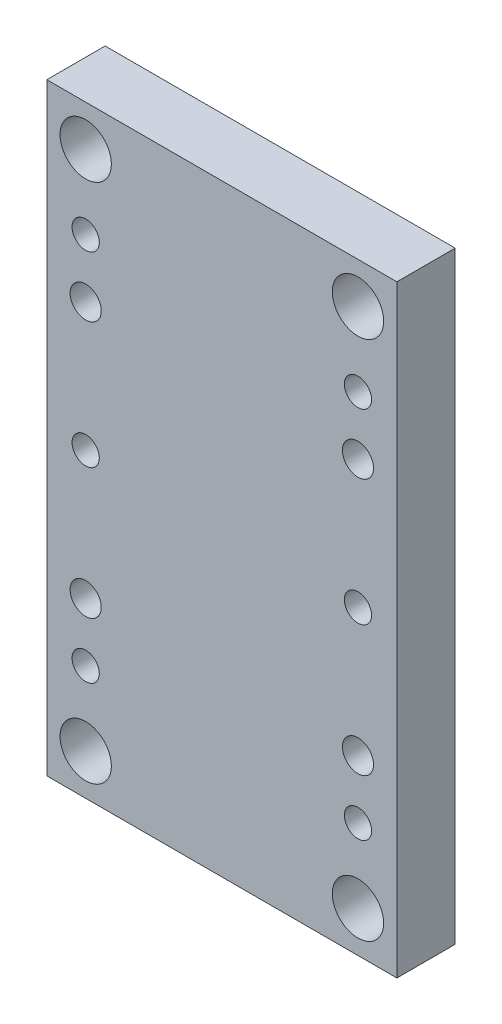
ISO-10303-21;
HEADER;
FILE_DESCRIPTION(('STEP AP214'),'2;1');
FILE_NAME('part.step','',(''),(''),'','','');
FILE_SCHEMA(('AUTOMOTIVE_DESIGN { 1 0 10303 214 1 1 1 1 }'));
ENDSEC;
DATA;
#1=APPLICATION_CONTEXT('core data for automotive mechanical design processes');
#2=APPLICATION_PROTOCOL_DEFINITION('international standard','automotive_design',2000,#1);
#3=PRODUCT_CONTEXT('',#1,'mechanical');
#4=PRODUCT('Part','Part','',(#3));
#5=PRODUCT_RELATED_PRODUCT_CATEGORY('part','',(#4));
#6=PRODUCT_DEFINITION_FORMATION('','',#4);
#7=PRODUCT_DEFINITION_CONTEXT('part definition',#1,'design');
#8=PRODUCT_DEFINITION('design','',#6,#7);
#9=PRODUCT_DEFINITION_SHAPE('','',#8);
#10=(LENGTH_UNIT() NAMED_UNIT(*) SI_UNIT(.MILLI.,.METRE.));
#11=(NAMED_UNIT(*) PLANE_ANGLE_UNIT() SI_UNIT($,.RADIAN.));
#12=(NAMED_UNIT(*) SI_UNIT($,.STERADIAN.) SOLID_ANGLE_UNIT());
#13=UNCERTAINTY_MEASURE_WITH_UNIT(LENGTH_MEASURE(1.E-05),#10,'distance_accuracy_value','');
#14=(GEOMETRIC_REPRESENTATION_CONTEXT(3) GLOBAL_UNCERTAINTY_ASSIGNED_CONTEXT((#13)) GLOBAL_UNIT_ASSIGNED_CONTEXT((#10,
#11,#12)) REPRESENTATION_CONTEXT('',''));
#15=CARTESIAN_POINT('',(0.,0.,0.));
#16=DIRECTION('',(0.,0.,1.));
#17=DIRECTION('',(1.,0.,0.));
#18=AXIS2_PLACEMENT_3D('',#15,#16,#17);
#19=CARTESIAN_POINT('',(-45.,-78.,15.));
#20=DIRECTION('',(0.,0.,1.));
#21=DIRECTION('',(1.,0.,0.));
#22=AXIS2_PLACEMENT_3D('',#19,#20,#21);
#23=PLANE('',#22);
#24=CARTESIAN_POINT('',(-35.,0.,15.));
#25=DIRECTION('',(0.,0.,1.));
#26=DIRECTION('',(1.,0.,0.));
#27=AXIS2_PLACEMENT_3D('',#24,#25,#26);
#28=CIRCLE('',#27,3.49999999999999);
#29=CARTESIAN_POINT('',(-31.5,0.,15.));
#30=VERTEX_POINT('',#29);
#31=EDGE_CURVE('E173',#30,#30,#28,.T.);
#32=ORIENTED_EDGE('',*,*,#31,.F.);
#33=EDGE_LOOP('',(#32));
#34=FACE_BOUND('',#33,.T.);
#35=CARTESIAN_POINT('',(-35.,-48.,15.));
#36=DIRECTION('',(0.,0.,1.));
#37=DIRECTION('',(1.,0.,0.));
#38=AXIS2_PLACEMENT_3D('',#35,#36,#37);
#39=CIRCLE('',#38,3.49999999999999);
#40=CARTESIAN_POINT('',(-31.5,-48.,15.));
#41=VERTEX_POINT('',#40);
#42=EDGE_CURVE('E167',#41,#41,#39,.T.);
#43=ORIENTED_EDGE('',*,*,#42,.F.);
#44=EDGE_LOOP('',(#43));
#45=FACE_BOUND('',#44,.T.);
#46=CARTESIAN_POINT('',(35.,-48.,15.));
#47=DIRECTION('',(0.,0.,1.));
#48=DIRECTION('',(1.,0.,0.));
#49=AXIS2_PLACEMENT_3D('',#46,#47,#48);
#50=CIRCLE('',#49,3.49999999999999);
#51=CARTESIAN_POINT('',(38.5,-48.,15.));
#52=VERTEX_POINT('',#51);
#53=EDGE_CURVE('E161',#52,#52,#50,.T.);
#54=ORIENTED_EDGE('',*,*,#53,.F.);
#55=EDGE_LOOP('',(#54));
#56=FACE_BOUND('',#55,.T.);
#57=CARTESIAN_POINT('',(-35.,48.,15.));
#58=DIRECTION('',(0.,0.,1.));
#59=DIRECTION('',(1.,0.,0.));
#60=AXIS2_PLACEMENT_3D('',#57,#58,#59);
#61=CIRCLE('',#60,3.49999999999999);
#62=CARTESIAN_POINT('',(-31.5,48.,15.));
#63=VERTEX_POINT('',#62);
#64=EDGE_CURVE('E155',#63,#63,#61,.T.);
#65=ORIENTED_EDGE('',*,*,#64,.F.);
#66=EDGE_LOOP('',(#65));
#67=FACE_BOUND('',#66,.T.);
#68=CARTESIAN_POINT('',(35.,48.,15.));
#69=DIRECTION('',(0.,0.,1.));
#70=DIRECTION('',(1.,0.,0.));
#71=AXIS2_PLACEMENT_3D('',#68,#69,#70);
#72=CIRCLE('',#71,3.49999999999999);
#73=CARTESIAN_POINT('',(38.5,48.,15.));
#74=VERTEX_POINT('',#73);
#75=EDGE_CURVE('E149',#74,#74,#72,.T.);
#76=ORIENTED_EDGE('',*,*,#75,.F.);
#77=EDGE_LOOP('',(#76));
#78=FACE_BOUND('',#77,.T.);
#79=CARTESIAN_POINT('',(35.,0.,15.));
#80=DIRECTION('',(0.,0.,1.));
#81=DIRECTION('',(1.,0.,0.));
#82=AXIS2_PLACEMENT_3D('',#79,#80,#81);
#83=CIRCLE('',#82,3.49999999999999);
#84=CARTESIAN_POINT('',(38.5,0.,15.));
#85=VERTEX_POINT('',#84);
#86=EDGE_CURVE('E143',#85,#85,#83,.T.);
#87=ORIENTED_EDGE('',*,*,#86,.F.);
#88=EDGE_LOOP('',(#87));
#89=FACE_BOUND('',#88,.T.);
#90=CARTESIAN_POINT('',(-35.,-67.,15.));
#91=DIRECTION('',(0.,0.,1.));
#92=DIRECTION('',(1.,0.,0.));
#93=AXIS2_PLACEMENT_3D('',#90,#91,#92);
#94=CIRCLE('',#93,6.6);
#95=CARTESIAN_POINT('',(-28.4,-67.,15.));
#96=VERTEX_POINT('',#95);
#97=EDGE_CURVE('E131',#96,#96,#94,.T.);
#98=ORIENTED_EDGE('',*,*,#97,.F.);
#99=EDGE_LOOP('',(#98));
#100=FACE_BOUND('',#99,.T.);
#101=CARTESIAN_POINT('',(-35.,-33.,15.));
#102=DIRECTION('',(0.,0.,1.));
#103=DIRECTION('',(1.,0.,0.));
#104=AXIS2_PLACEMENT_3D('',#101,#102,#103);
#105=CIRCLE('',#104,4.00375);
#106=CARTESIAN_POINT('',(-30.99625,-33.,15.));
#107=VERTEX_POINT('',#106);
#108=EDGE_CURVE('E119',#107,#107,#105,.T.);
#109=ORIENTED_EDGE('',*,*,#108,.F.);
#110=EDGE_LOOP('',(#109));
#111=FACE_BOUND('',#110,.T.);
#112=CARTESIAN_POINT('',(35.,67.,15.));
#113=DIRECTION('',(0.,0.,1.));
#114=DIRECTION('',(1.,0.,0.));
#115=AXIS2_PLACEMENT_3D('',#112,#113,#114);
#116=CIRCLE('',#115,6.6);
#117=CARTESIAN_POINT('',(41.6,67.,15.));
#118=VERTEX_POINT('',#117);
#119=EDGE_CURVE('E107',#118,#118,#116,.T.);
#120=ORIENTED_EDGE('',*,*,#119,.F.);
#121=EDGE_LOOP('',(#120));
#122=FACE_BOUND('',#121,.T.);
#123=CARTESIAN_POINT('',(35.,33.,15.));
#124=DIRECTION('',(0.,0.,1.));
#125=DIRECTION('',(1.,0.,0.));
#126=AXIS2_PLACEMENT_3D('',#123,#124,#125);
#127=CIRCLE('',#126,4.00375);
#128=CARTESIAN_POINT('',(39.00375,33.,15.));
#129=VERTEX_POINT('',#128);
#130=EDGE_CURVE('E93',#129,#129,#127,.T.);
#131=ORIENTED_EDGE('',*,*,#130,.F.);
#132=EDGE_LOOP('',(#131));
#133=FACE_BOUND('',#132,.T.);
#134=CARTESIAN_POINT('',(35.,-33.,15.));
#135=DIRECTION('',(0.,0.,1.));
#136=DIRECTION('',(1.,0.,0.));
#137=AXIS2_PLACEMENT_3D('',#134,#135,#136);
#138=CIRCLE('',#137,4.00375);
#139=CARTESIAN_POINT('',(39.00375,-33.,15.));
#140=VERTEX_POINT('',#139);
#141=EDGE_CURVE('E101',#140,#140,#138,.T.);
#142=ORIENTED_EDGE('',*,*,#141,.F.);
#143=EDGE_LOOP('',(#142));
#144=FACE_BOUND('',#143,.T.);
#145=CARTESIAN_POINT('',(35.,-67.,15.));
#146=DIRECTION('',(0.,0.,1.));
#147=DIRECTION('',(1.,0.,0.));
#148=AXIS2_PLACEMENT_3D('',#145,#146,#147);
#149=CIRCLE('',#148,6.6);
#150=CARTESIAN_POINT('',(41.6,-67.,15.));
#151=VERTEX_POINT('',#150);
#152=EDGE_CURVE('E113',#151,#151,#149,.T.);
#153=ORIENTED_EDGE('',*,*,#152,.F.);
#154=EDGE_LOOP('',(#153));
#155=FACE_BOUND('',#154,.T.);
#156=CARTESIAN_POINT('',(-35.,33.,15.));
#157=DIRECTION('',(0.,0.,1.));
#158=DIRECTION('',(1.,0.,0.));
#159=AXIS2_PLACEMENT_3D('',#156,#157,#158);
#160=CIRCLE('',#159,4.00375);
#161=CARTESIAN_POINT('',(-30.99625,33.,15.));
#162=VERTEX_POINT('',#161);
#163=EDGE_CURVE('E125',#162,#162,#160,.T.);
#164=ORIENTED_EDGE('',*,*,#163,.F.);
#165=EDGE_LOOP('',(#164));
#166=FACE_BOUND('',#165,.T.);
#167=CARTESIAN_POINT('',(-35.,67.,15.));
#168=DIRECTION('',(0.,0.,1.));
#169=DIRECTION('',(1.,0.,0.));
#170=AXIS2_PLACEMENT_3D('',#167,#168,#169);
#171=CIRCLE('',#170,6.6);
#172=CARTESIAN_POINT('',(-28.4,67.,15.));
#173=VERTEX_POINT('',#172);
#174=EDGE_CURVE('E137',#173,#173,#171,.T.);
#175=ORIENTED_EDGE('',*,*,#174,.F.);
#176=EDGE_LOOP('',(#175));
#177=FACE_BOUND('',#176,.T.);
#178=DIRECTION('',(0.,-1.,0.));
#179=VECTOR('',#178,1.);
#180=CARTESIAN_POINT('',(-45.,78.,15.));
#181=LINE('',#180,#179);
#182=CARTESIAN_POINT('',(-45.,77.5,15.));
#183=VERTEX_POINT('',#182);
#184=CARTESIAN_POINT('',(-45.,-77.5,15.));
#185=VERTEX_POINT('',#184);
#186=EDGE_CURVE('E40',#183,#185,#181,.T.);
#187=ORIENTED_EDGE('',*,*,#186,.T.);
#188=DIRECTION('',(1.,0.,0.));
#189=VECTOR('',#188,1.);
#190=CARTESIAN_POINT('',(-45.,-77.5,15.));
#191=LINE('',#190,#189);
#192=CARTESIAN_POINT('',(45.,-77.5,15.));
#193=VERTEX_POINT('',#192);
#194=EDGE_CURVE('E87',#185,#193,#191,.T.);
#195=ORIENTED_EDGE('',*,*,#194,.T.);
#196=DIRECTION('',(0.,1.,0.));
#197=VECTOR('',#196,1.);
#198=CARTESIAN_POINT('',(45.,-78.,15.));
#199=LINE('',#198,#197);
#200=CARTESIAN_POINT('',(45.,77.5,15.));
#201=VERTEX_POINT('',#200);
#202=EDGE_CURVE('E12',#193,#201,#199,.T.);
#203=ORIENTED_EDGE('',*,*,#202,.T.);
#204=DIRECTION('',(-1.,0.,0.));
#205=VECTOR('',#204,1.);
#206=CARTESIAN_POINT('',(-45.,77.5,15.));
#207=LINE('',#206,#205);
#208=EDGE_CURVE('E47',#201,#183,#207,.T.);
#209=ORIENTED_EDGE('',*,*,#208,.T.);
#210=EDGE_LOOP('',(#187,#195,#203,#209));
#211=FACE_BOUND('',#210,.T.);
#212=ADVANCED_FACE('F32',(#34,#45,#56,#67,#78,#89,#100,#111,#122,#133,#144,#155,#166,#177,#211),
#23,.T.);
#213=CARTESIAN_POINT('',(-45.,-78.,0.));
#214=DIRECTION('',(0.,0.,1.));
#215=DIRECTION('',(1.,0.,0.));
#216=AXIS2_PLACEMENT_3D('',#213,#214,#215);
#217=PLANE('',#216);
#218=CARTESIAN_POINT('',(-35.,0.,0.));
#219=DIRECTION('',(0.,0.,1.));
#220=DIRECTION('',(1.,0.,0.));
#221=AXIS2_PLACEMENT_3D('',#218,#219,#220);
#222=CIRCLE('',#221,3.5);
#223=CARTESIAN_POINT('',(-31.5,0.,0.));
#224=VERTEX_POINT('',#223);
#225=EDGE_CURVE('E176',#224,#224,#222,.T.);
#226=ORIENTED_EDGE('',*,*,#225,.T.);
#227=EDGE_LOOP('',(#226));
#228=FACE_BOUND('',#227,.T.);
#229=CARTESIAN_POINT('',(-35.,-48.,0.));
#230=DIRECTION('',(0.,0.,1.));
#231=DIRECTION('',(1.,0.,0.));
#232=AXIS2_PLACEMENT_3D('',#229,#230,#231);
#233=CIRCLE('',#232,3.5);
#234=CARTESIAN_POINT('',(-31.5,-48.,0.));
#235=VERTEX_POINT('',#234);
#236=EDGE_CURVE('E170',#235,#235,#233,.T.);
#237=ORIENTED_EDGE('',*,*,#236,.T.);
#238=EDGE_LOOP('',(#237));
#239=FACE_BOUND('',#238,.T.);
#240=CARTESIAN_POINT('',(35.,-48.,0.));
#241=DIRECTION('',(0.,0.,1.));
#242=DIRECTION('',(1.,0.,0.));
#243=AXIS2_PLACEMENT_3D('',#240,#241,#242);
#244=CIRCLE('',#243,3.5);
#245=CARTESIAN_POINT('',(38.5,-48.,0.));
#246=VERTEX_POINT('',#245);
#247=EDGE_CURVE('E164',#246,#246,#244,.T.);
#248=ORIENTED_EDGE('',*,*,#247,.T.);
#249=EDGE_LOOP('',(#248));
#250=FACE_BOUND('',#249,.T.);
#251=CARTESIAN_POINT('',(-35.,48.,0.));
#252=DIRECTION('',(0.,0.,1.));
#253=DIRECTION('',(1.,0.,0.));
#254=AXIS2_PLACEMENT_3D('',#251,#252,#253);
#255=CIRCLE('',#254,3.5);
#256=CARTESIAN_POINT('',(-31.5,48.,0.));
#257=VERTEX_POINT('',#256);
#258=EDGE_CURVE('E158',#257,#257,#255,.T.);
#259=ORIENTED_EDGE('',*,*,#258,.T.);
#260=EDGE_LOOP('',(#259));
#261=FACE_BOUND('',#260,.T.);
#262=CARTESIAN_POINT('',(35.,48.,0.));
#263=DIRECTION('',(0.,0.,1.));
#264=DIRECTION('',(1.,0.,0.));
#265=AXIS2_PLACEMENT_3D('',#262,#263,#264);
#266=CIRCLE('',#265,3.5);
#267=CARTESIAN_POINT('',(38.5,48.,0.));
#268=VERTEX_POINT('',#267);
#269=EDGE_CURVE('E152',#268,#268,#266,.T.);
#270=ORIENTED_EDGE('',*,*,#269,.T.);
#271=EDGE_LOOP('',(#270));
#272=FACE_BOUND('',#271,.T.);
#273=CARTESIAN_POINT('',(35.,0.,0.));
#274=DIRECTION('',(0.,0.,1.));
#275=DIRECTION('',(1.,0.,0.));
#276=AXIS2_PLACEMENT_3D('',#273,#274,#275);
#277=CIRCLE('',#276,3.5);
#278=CARTESIAN_POINT('',(38.5,0.,0.));
#279=VERTEX_POINT('',#278);
#280=EDGE_CURVE('E146',#279,#279,#277,.T.);
#281=ORIENTED_EDGE('',*,*,#280,.T.);
#282=EDGE_LOOP('',(#281));
#283=FACE_BOUND('',#282,.T.);
#284=CARTESIAN_POINT('',(-35.,-67.,0.));
#285=DIRECTION('',(0.,0.,1.));
#286=DIRECTION('',(1.,0.,0.));
#287=AXIS2_PLACEMENT_3D('',#284,#285,#286);
#288=CIRCLE('',#287,6.6);
#289=CARTESIAN_POINT('',(-28.4,-67.,0.));
#290=VERTEX_POINT('',#289);
#291=EDGE_CURVE('E134',#290,#290,#288,.T.);
#292=ORIENTED_EDGE('',*,*,#291,.T.);
#293=EDGE_LOOP('',(#292));
#294=FACE_BOUND('',#293,.T.);
#295=CARTESIAN_POINT('',(-35.,-33.,0.));
#296=DIRECTION('',(0.,0.,1.));
#297=DIRECTION('',(1.,0.,0.));
#298=AXIS2_PLACEMENT_3D('',#295,#296,#297);
#299=CIRCLE('',#298,4.00375);
#300=CARTESIAN_POINT('',(-30.99625,-33.,0.));
#301=VERTEX_POINT('',#300);
#302=EDGE_CURVE('E122',#301,#301,#299,.T.);
#303=ORIENTED_EDGE('',*,*,#302,.T.);
#304=EDGE_LOOP('',(#303));
#305=FACE_BOUND('',#304,.T.);
#306=CARTESIAN_POINT('',(35.,67.,0.));
#307=DIRECTION('',(0.,0.,1.));
#308=DIRECTION('',(1.,0.,0.));
#309=AXIS2_PLACEMENT_3D('',#306,#307,#308);
#310=CIRCLE('',#309,6.6);
#311=CARTESIAN_POINT('',(41.6,67.,0.));
#312=VERTEX_POINT('',#311);
#313=EDGE_CURVE('E110',#312,#312,#310,.T.);
#314=ORIENTED_EDGE('',*,*,#313,.T.);
#315=EDGE_LOOP('',(#314));
#316=FACE_BOUND('',#315,.T.);
#317=CARTESIAN_POINT('',(35.,33.,0.));
#318=DIRECTION('',(0.,0.,1.));
#319=DIRECTION('',(1.,0.,0.));
#320=AXIS2_PLACEMENT_3D('',#317,#318,#319);
#321=CIRCLE('',#320,4.00375);
#322=CARTESIAN_POINT('',(39.00375,33.,0.));
#323=VERTEX_POINT('',#322);
#324=EDGE_CURVE('E98',#323,#323,#321,.T.);
#325=ORIENTED_EDGE('',*,*,#324,.T.);
#326=EDGE_LOOP('',(#325));
#327=FACE_BOUND('',#326,.T.);
#328=CARTESIAN_POINT('',(35.,-33.,0.));
#329=DIRECTION('',(0.,0.,1.));
#330=DIRECTION('',(1.,0.,0.));
#331=AXIS2_PLACEMENT_3D('',#328,#329,#330);
#332=CIRCLE('',#331,4.00375);
#333=CARTESIAN_POINT('',(39.00375,-33.,0.));
#334=VERTEX_POINT('',#333);
#335=EDGE_CURVE('E104',#334,#334,#332,.T.);
#336=ORIENTED_EDGE('',*,*,#335,.T.);
#337=EDGE_LOOP('',(#336));
#338=FACE_BOUND('',#337,.T.);
#339=CARTESIAN_POINT('',(35.,-67.,0.));
#340=DIRECTION('',(0.,0.,1.));
#341=DIRECTION('',(1.,0.,0.));
#342=AXIS2_PLACEMENT_3D('',#339,#340,#341);
#343=CIRCLE('',#342,6.6);
#344=CARTESIAN_POINT('',(41.6,-67.,0.));
#345=VERTEX_POINT('',#344);
#346=EDGE_CURVE('E116',#345,#345,#343,.T.);
#347=ORIENTED_EDGE('',*,*,#346,.T.);
#348=EDGE_LOOP('',(#347));
#349=FACE_BOUND('',#348,.T.);
#350=CARTESIAN_POINT('',(-35.,33.,0.));
#351=DIRECTION('',(0.,0.,1.));
#352=DIRECTION('',(1.,0.,0.));
#353=AXIS2_PLACEMENT_3D('',#350,#351,#352);
#354=CIRCLE('',#353,4.00375);
#355=CARTESIAN_POINT('',(-30.99625,33.,0.));
#356=VERTEX_POINT('',#355);
#357=EDGE_CURVE('E128',#356,#356,#354,.T.);
#358=ORIENTED_EDGE('',*,*,#357,.T.);
#359=EDGE_LOOP('',(#358));
#360=FACE_BOUND('',#359,.T.);
#361=CARTESIAN_POINT('',(-35.,67.,0.));
#362=DIRECTION('',(0.,0.,1.));
#363=DIRECTION('',(1.,0.,0.));
#364=AXIS2_PLACEMENT_3D('',#361,#362,#363);
#365=CIRCLE('',#364,6.6);
#366=CARTESIAN_POINT('',(-28.4,67.,0.));
#367=VERTEX_POINT('',#366);
#368=EDGE_CURVE('E140',#367,#367,#365,.T.);
#369=ORIENTED_EDGE('',*,*,#368,.T.);
#370=EDGE_LOOP('',(#369));
#371=FACE_BOUND('',#370,.T.);
#372=DIRECTION('',(1.,0.,0.));
#373=VECTOR('',#372,1.);
#374=CARTESIAN_POINT('',(-45.,-77.5,0.));
#375=LINE('',#374,#373);
#376=CARTESIAN_POINT('',(-45.,-77.5,0.));
#377=VERTEX_POINT('',#376);
#378=CARTESIAN_POINT('',(45.,-77.5,0.));
#379=VERTEX_POINT('',#378);
#380=EDGE_CURVE('E55',#377,#379,#375,.T.);
#381=ORIENTED_EDGE('',*,*,#380,.F.);
#382=DIRECTION('',(0.,-1.,0.));
#383=VECTOR('',#382,1.);
#384=CARTESIAN_POINT('',(-45.,78.,0.));
#385=LINE('',#384,#383);
#386=CARTESIAN_POINT('',(-45.,77.5,0.));
#387=VERTEX_POINT('',#386);
#388=EDGE_CURVE('E86',#387,#377,#385,.T.);
#389=ORIENTED_EDGE('',*,*,#388,.F.);
#390=DIRECTION('',(-1.,0.,0.));
#391=VECTOR('',#390,1.);
#392=CARTESIAN_POINT('',(-45.,77.5,0.));
#393=LINE('',#392,#391);
#394=CARTESIAN_POINT('',(45.,77.5,0.));
#395=VERTEX_POINT('',#394);
#396=EDGE_CURVE('E73',#395,#387,#393,.T.);
#397=ORIENTED_EDGE('',*,*,#396,.F.);
#398=DIRECTION('',(0.,1.,0.));
#399=VECTOR('',#398,1.);
#400=CARTESIAN_POINT('',(45.,-78.,0.));
#401=LINE('',#400,#399);
#402=EDGE_CURVE('E84',#379,#395,#401,.T.);
#403=ORIENTED_EDGE('',*,*,#402,.F.);
#404=EDGE_LOOP('',(#381,#389,#397,#403));
#405=FACE_BOUND('',#404,.T.);
#406=ADVANCED_FACE('F83',(#228,#239,#250,#261,#272,#283,#294,#305,#316,#327,#338,#349,#360,#371,
#405),#217,.F.);
#407=CARTESIAN_POINT('',(-45.,78.,15.));
#408=DIRECTION('',(1.,0.,0.));
#409=DIRECTION('',(0.,0.,-1.));
#410=AXIS2_PLACEMENT_3D('',#407,#408,#409);
#411=PLANE('',#410);
#412=DIRECTION('',(0.,0.,1.));
#413=VECTOR('',#412,1.);
#414=CARTESIAN_POINT('',(-45.,-77.5,0.));
#415=LINE('',#414,#413);
#416=EDGE_CURVE('E180',#377,#185,#415,.T.);
#417=ORIENTED_EDGE('',*,*,#416,.T.);
#418=ORIENTED_EDGE('',*,*,#186,.F.);
#419=DIRECTION('',(0.,0.,1.));
#420=VECTOR('',#419,1.);
#421=CARTESIAN_POINT('',(-45.,77.5,0.));
#422=LINE('',#421,#420);
#423=EDGE_CURVE('E78',#387,#183,#422,.T.);
#424=ORIENTED_EDGE('',*,*,#423,.F.);
#425=ORIENTED_EDGE('',*,*,#388,.T.);
#426=EDGE_LOOP('',(#417,#418,#424,#425));
#427=FACE_BOUND('',#426,.T.);
#428=ADVANCED_FACE('F34',(#427),#411,.F.);
#429=CARTESIAN_POINT('',(45.,-78.,15.));
#430=DIRECTION('',(-1.,0.,0.));
#431=DIRECTION('',(0.,0.,1.));
#432=AXIS2_PLACEMENT_3D('',#429,#430,#431);
#433=PLANE('',#432);
#434=DIRECTION('',(0.,0.,1.));
#435=VECTOR('',#434,1.);
#436=CARTESIAN_POINT('',(45.,-77.5,0.));
#437=LINE('',#436,#435);
#438=EDGE_CURVE('E90',#379,#193,#437,.T.);
#439=ORIENTED_EDGE('',*,*,#438,.F.);
#440=ORIENTED_EDGE('',*,*,#402,.T.);
#441=DIRECTION('',(0.,0.,1.));
#442=VECTOR('',#441,1.);
#443=CARTESIAN_POINT('',(45.,77.5,0.));
#444=LINE('',#443,#442);
#445=EDGE_CURVE('E70',#395,#201,#444,.T.);
#446=ORIENTED_EDGE('',*,*,#445,.T.);
#447=ORIENTED_EDGE('',*,*,#202,.F.);
#448=EDGE_LOOP('',(#439,#440,#446,#447));
#449=FACE_BOUND('',#448,.T.);
#450=ADVANCED_FACE('F89',(#449),#433,.F.);
#451=CARTESIAN_POINT('',(35.,33.,15.));
#452=DIRECTION('',(0.,0.,-1.));
#453=DIRECTION('',(-1.,0.,0.));
#454=AXIS2_PLACEMENT_3D('',#451,#452,#453);
#455=CYLINDRICAL_SURFACE('',#454,4.00375);
#456=ORIENTED_EDGE('',*,*,#130,.T.);
#457=EDGE_LOOP('',(#456));
#458=FACE_BOUND('',#457,.T.);
#459=ORIENTED_EDGE('',*,*,#324,.F.);
#460=EDGE_LOOP('',(#459));
#461=FACE_BOUND('',#460,.T.);
#462=ADVANCED_FACE('F210',(#458,#461),#455,.F.);
#463=CARTESIAN_POINT('',(35.,-33.,15.));
#464=DIRECTION('',(0.,0.,-1.));
#465=DIRECTION('',(-1.,0.,0.));
#466=AXIS2_PLACEMENT_3D('',#463,#464,#465);
#467=CYLINDRICAL_SURFACE('',#466,4.00375);
#468=ORIENTED_EDGE('',*,*,#141,.T.);
#469=EDGE_LOOP('',(#468));
#470=FACE_BOUND('',#469,.T.);
#471=ORIENTED_EDGE('',*,*,#335,.F.);
#472=EDGE_LOOP('',(#471));
#473=FACE_BOUND('',#472,.T.);
#474=ADVANCED_FACE('F215',(#470,#473),#467,.F.);
#475=CARTESIAN_POINT('',(35.,67.,15.));
#476=DIRECTION('',(0.,0.,-1.));
#477=DIRECTION('',(-1.,0.,0.));
#478=AXIS2_PLACEMENT_3D('',#475,#476,#477);
#479=CYLINDRICAL_SURFACE('',#478,6.6);
#480=ORIENTED_EDGE('',*,*,#119,.T.);
#481=EDGE_LOOP('',(#480));
#482=FACE_BOUND('',#481,.T.);
#483=ORIENTED_EDGE('',*,*,#313,.F.);
#484=EDGE_LOOP('',(#483));
#485=FACE_BOUND('',#484,.T.);
#486=ADVANCED_FACE('F338',(#482,#485),#479,.F.);
#487=CARTESIAN_POINT('',(35.,-67.,15.));
#488=DIRECTION('',(0.,0.,-1.));
#489=DIRECTION('',(-1.,0.,0.));
#490=AXIS2_PLACEMENT_3D('',#487,#488,#489);
#491=CYLINDRICAL_SURFACE('',#490,6.6);
#492=ORIENTED_EDGE('',*,*,#152,.T.);
#493=EDGE_LOOP('',(#492));
#494=FACE_BOUND('',#493,.T.);
#495=ORIENTED_EDGE('',*,*,#346,.F.);
#496=EDGE_LOOP('',(#495));
#497=FACE_BOUND('',#496,.T.);
#498=ADVANCED_FACE('F328',(#494,#497),#491,.F.);
#499=CARTESIAN_POINT('',(-35.,-33.,15.));
#500=DIRECTION('',(0.,0.,-1.));
#501=DIRECTION('',(-1.,0.,0.));
#502=AXIS2_PLACEMENT_3D('',#499,#500,#501);
#503=CYLINDRICAL_SURFACE('',#502,4.00375);
#504=ORIENTED_EDGE('',*,*,#108,.T.);
#505=EDGE_LOOP('',(#504));
#506=FACE_BOUND('',#505,.T.);
#507=ORIENTED_EDGE('',*,*,#302,.F.);
#508=EDGE_LOOP('',(#507));
#509=FACE_BOUND('',#508,.T.);
#510=ADVANCED_FACE('F318',(#506,#509),#503,.F.);
#511=CARTESIAN_POINT('',(-35.,33.,15.));
#512=DIRECTION('',(0.,0.,-1.));
#513=DIRECTION('',(-1.,0.,0.));
#514=AXIS2_PLACEMENT_3D('',#511,#512,#513);
#515=CYLINDRICAL_SURFACE('',#514,4.00375);
#516=ORIENTED_EDGE('',*,*,#163,.T.);
#517=EDGE_LOOP('',(#516));
#518=FACE_BOUND('',#517,.T.);
#519=ORIENTED_EDGE('',*,*,#357,.F.);
#520=EDGE_LOOP('',(#519));
#521=FACE_BOUND('',#520,.T.);
#522=ADVANCED_FACE('F308',(#518,#521),#515,.F.);
#523=CARTESIAN_POINT('',(-35.,-67.,15.));
#524=DIRECTION('',(0.,0.,-1.));
#525=DIRECTION('',(-1.,0.,0.));
#526=AXIS2_PLACEMENT_3D('',#523,#524,#525);
#527=CYLINDRICAL_SURFACE('',#526,6.6);
#528=ORIENTED_EDGE('',*,*,#97,.T.);
#529=EDGE_LOOP('',(#528));
#530=FACE_BOUND('',#529,.T.);
#531=ORIENTED_EDGE('',*,*,#291,.F.);
#532=EDGE_LOOP('',(#531));
#533=FACE_BOUND('',#532,.T.);
#534=ADVANCED_FACE('F298',(#530,#533),#527,.F.);
#535=CARTESIAN_POINT('',(-35.,67.,15.));
#536=DIRECTION('',(0.,0.,-1.));
#537=DIRECTION('',(-1.,0.,0.));
#538=AXIS2_PLACEMENT_3D('',#535,#536,#537);
#539=CYLINDRICAL_SURFACE('',#538,6.6);
#540=ORIENTED_EDGE('',*,*,#174,.T.);
#541=EDGE_LOOP('',(#540));
#542=FACE_BOUND('',#541,.T.);
#543=ORIENTED_EDGE('',*,*,#368,.F.);
#544=EDGE_LOOP('',(#543));
#545=FACE_BOUND('',#544,.T.);
#546=ADVANCED_FACE('F288',(#542,#545),#539,.F.);
#547=CARTESIAN_POINT('',(35.,0.,15.));
#548=DIRECTION('',(0.,0.,1.));
#549=DIRECTION('',(1.,0.,0.));
#550=AXIS2_PLACEMENT_3D('',#547,#548,#549);
#551=CYLINDRICAL_SURFACE('',#550,3.49999999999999);
#552=ORIENTED_EDGE('',*,*,#280,.F.);
#553=EDGE_LOOP('',(#552));
#554=FACE_BOUND('',#553,.T.);
#555=ORIENTED_EDGE('',*,*,#86,.T.);
#556=EDGE_LOOP('',(#555));
#557=FACE_BOUND('',#556,.T.);
#558=ADVANCED_FACE('F278',(#554,#557),#551,.F.);
#559=CARTESIAN_POINT('',(35.,48.,15.));
#560=DIRECTION('',(0.,0.,1.));
#561=DIRECTION('',(1.,0.,0.));
#562=AXIS2_PLACEMENT_3D('',#559,#560,#561);
#563=CYLINDRICAL_SURFACE('',#562,3.49999999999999);
#564=ORIENTED_EDGE('',*,*,#269,.F.);
#565=EDGE_LOOP('',(#564));
#566=FACE_BOUND('',#565,.T.);
#567=ORIENTED_EDGE('',*,*,#75,.T.);
#568=EDGE_LOOP('',(#567));
#569=FACE_BOUND('',#568,.T.);
#570=ADVANCED_FACE('F268',(#566,#569),#563,.F.);
#571=CARTESIAN_POINT('',(-35.,48.,15.));
#572=DIRECTION('',(0.,0.,1.));
#573=DIRECTION('',(1.,0.,0.));
#574=AXIS2_PLACEMENT_3D('',#571,#572,#573);
#575=CYLINDRICAL_SURFACE('',#574,3.49999999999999);
#576=ORIENTED_EDGE('',*,*,#258,.F.);
#577=EDGE_LOOP('',(#576));
#578=FACE_BOUND('',#577,.T.);
#579=ORIENTED_EDGE('',*,*,#64,.T.);
#580=EDGE_LOOP('',(#579));
#581=FACE_BOUND('',#580,.T.);
#582=ADVANCED_FACE('F258',(#578,#581),#575,.F.);
#583=CARTESIAN_POINT('',(35.,-48.,15.));
#584=DIRECTION('',(0.,0.,1.));
#585=DIRECTION('',(1.,0.,0.));
#586=AXIS2_PLACEMENT_3D('',#583,#584,#585);
#587=CYLINDRICAL_SURFACE('',#586,3.49999999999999);
#588=ORIENTED_EDGE('',*,*,#247,.F.);
#589=EDGE_LOOP('',(#588));
#590=FACE_BOUND('',#589,.T.);
#591=ORIENTED_EDGE('',*,*,#53,.T.);
#592=EDGE_LOOP('',(#591));
#593=FACE_BOUND('',#592,.T.);
#594=ADVANCED_FACE('F248',(#590,#593),#587,.F.);
#595=CARTESIAN_POINT('',(-35.,-48.,15.));
#596=DIRECTION('',(0.,0.,1.));
#597=DIRECTION('',(1.,0.,0.));
#598=AXIS2_PLACEMENT_3D('',#595,#596,#597);
#599=CYLINDRICAL_SURFACE('',#598,3.49999999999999);
#600=ORIENTED_EDGE('',*,*,#236,.F.);
#601=EDGE_LOOP('',(#600));
#602=FACE_BOUND('',#601,.T.);
#603=ORIENTED_EDGE('',*,*,#42,.T.);
#604=EDGE_LOOP('',(#603));
#605=FACE_BOUND('',#604,.T.);
#606=ADVANCED_FACE('F237',(#602,#605),#599,.F.);
#607=CARTESIAN_POINT('',(-35.,0.,15.));
#608=DIRECTION('',(0.,0.,1.));
#609=DIRECTION('',(1.,0.,0.));
#610=AXIS2_PLACEMENT_3D('',#607,#608,#609);
#611=CYLINDRICAL_SURFACE('',#610,3.49999999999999);
#612=ORIENTED_EDGE('',*,*,#225,.F.);
#613=EDGE_LOOP('',(#612));
#614=FACE_BOUND('',#613,.T.);
#615=ORIENTED_EDGE('',*,*,#31,.T.);
#616=EDGE_LOOP('',(#615));
#617=FACE_BOUND('',#616,.T.);
#618=ADVANCED_FACE('F196',(#614,#617),#611,.F.);
#619=CARTESIAN_POINT('',(-45.,77.5,0.));
#620=DIRECTION('',(0.,1.,0.));
#621=DIRECTION('',(-1.,0.,0.));
#622=AXIS2_PLACEMENT_3D('',#619,#620,#621);
#623=PLANE('',#622);
#624=ORIENTED_EDGE('',*,*,#208,.F.);
#625=ORIENTED_EDGE('',*,*,#445,.F.);
#626=ORIENTED_EDGE('',*,*,#396,.T.);
#627=ORIENTED_EDGE('',*,*,#423,.T.);
#628=EDGE_LOOP('',(#624,#625,#626,#627));
#629=FACE_BOUND('',#628,.T.);
#630=ADVANCED_FACE('F72',(#629),#623,.T.);
#631=CARTESIAN_POINT('',(-45.,-77.5,0.));
#632=DIRECTION('',(0.,-1.,0.));
#633=DIRECTION('',(1.,0.,0.));
#634=AXIS2_PLACEMENT_3D('',#631,#632,#633);
#635=PLANE('',#634);
#636=ORIENTED_EDGE('',*,*,#194,.F.);
#637=ORIENTED_EDGE('',*,*,#416,.F.);
#638=ORIENTED_EDGE('',*,*,#380,.T.);
#639=ORIENTED_EDGE('',*,*,#438,.T.);
#640=EDGE_LOOP('',(#636,#637,#638,#639));
#641=FACE_BOUND('',#640,.T.);
#642=ADVANCED_FACE('F190',(#641),#635,.T.);
#643=CLOSED_SHELL('',(#212,#406,#428,#450,#462,#474,#486,#498,#510,#522,#534,#546,#558,#570,
#582,#594,#606,#618,#630,#642));
#644=MANIFOLD_SOLID_BREP('B2',#643);
#645=ADVANCED_BREP_SHAPE_REPRESENTATION('',(#18,#644),#14);
#646=SHAPE_DEFINITION_REPRESENTATION(#9,#645);
ENDSEC;
END-ISO-10303-21;
